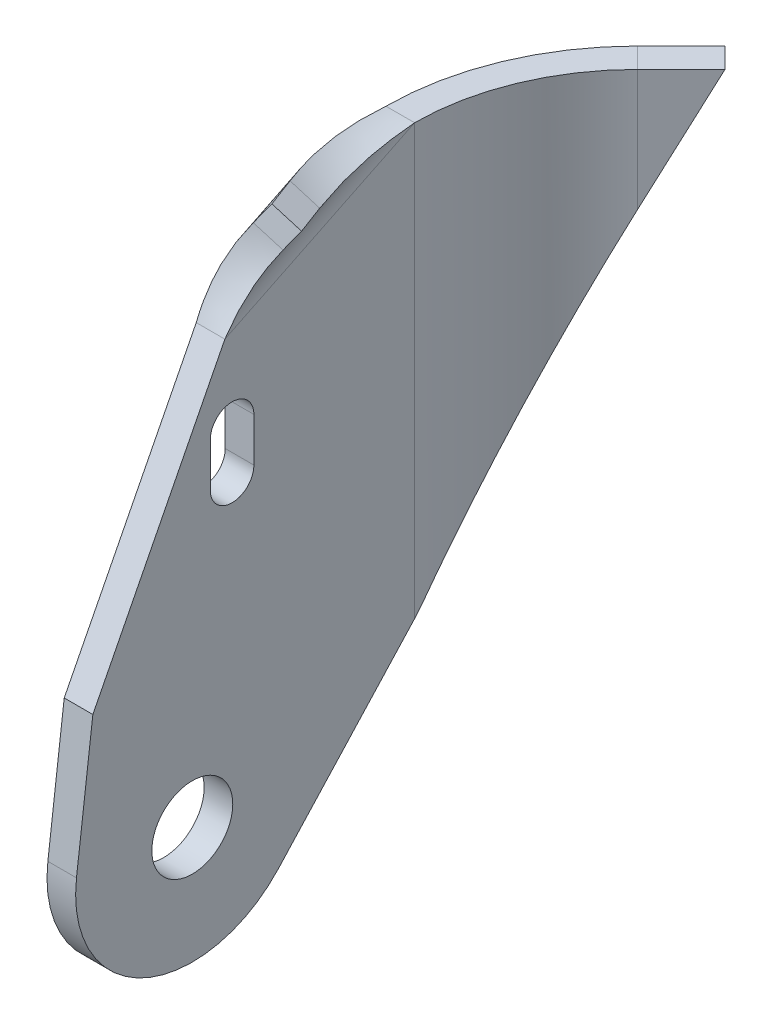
ISO-10303-21;
HEADER;
FILE_DESCRIPTION(('STEP AP214'),'2;1');
FILE_NAME('part.step','',(''),(''),'','','');
FILE_SCHEMA(('AUTOMOTIVE_DESIGN { 1 0 10303 214 1 1 1 1 }'));
ENDSEC;
DATA;
#1=APPLICATION_CONTEXT('core data for automotive mechanical design processes');
#2=APPLICATION_PROTOCOL_DEFINITION('international standard','automotive_design',2000,#1);
#3=PRODUCT_CONTEXT('',#1,'mechanical');
#4=PRODUCT('Part','Part','',(#3));
#5=PRODUCT_RELATED_PRODUCT_CATEGORY('part','',(#4));
#6=PRODUCT_DEFINITION_FORMATION('','',#4);
#7=PRODUCT_DEFINITION_CONTEXT('part definition',#1,'design');
#8=PRODUCT_DEFINITION('design','',#6,#7);
#9=PRODUCT_DEFINITION_SHAPE('','',#8);
#10=(LENGTH_UNIT() NAMED_UNIT(*) SI_UNIT(.MILLI.,.METRE.));
#11=(NAMED_UNIT(*) PLANE_ANGLE_UNIT() SI_UNIT($,.RADIAN.));
#12=(NAMED_UNIT(*) SI_UNIT($,.STERADIAN.) SOLID_ANGLE_UNIT());
#13=UNCERTAINTY_MEASURE_WITH_UNIT(LENGTH_MEASURE(1.E-05),#10,'distance_accuracy_value','');
#14=(GEOMETRIC_REPRESENTATION_CONTEXT(3) GLOBAL_UNCERTAINTY_ASSIGNED_CONTEXT((#13)) GLOBAL_UNIT_ASSIGNED_CONTEXT((#10,
#11,#12)) REPRESENTATION_CONTEXT('',''));
#15=CARTESIAN_POINT('',(0.,0.,0.));
#16=DIRECTION('',(0.,0.,1.));
#17=DIRECTION('',(1.,0.,0.));
#18=AXIS2_PLACEMENT_3D('',#15,#16,#17);
#19=CARTESIAN_POINT('',(3.30473425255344,-100.5332,3.30473425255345));
#20=DIRECTION('',(0.707106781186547,0.,0.707106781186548));
#21=DIRECTION('',(0.707106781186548,0.,-0.707106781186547));
#22=AXIS2_PLACEMENT_3D('',#19,#20,#21);
#23=PLANE('',#22);
#24=DIRECTION('',(0.,1.,0.));
#25=VECTOR('',#24,1.);
#26=CARTESIAN_POINT('',(15.3418254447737,-100.5332,-8.73235693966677));
#27=LINE('',#26,#25);
#28=CARTESIAN_POINT('',(15.3418254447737,-19.7797311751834,-8.73235693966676));
#29=VERTEX_POINT('',#28);
#30=CARTESIAN_POINT('',(15.3418254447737,0.,-8.73235693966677));
#31=VERTEX_POINT('',#30);
#32=EDGE_CURVE('E701',#29,#31,#27,.T.);
#33=ORIENTED_EDGE('',*,*,#32,.F.);
#34=DIRECTION('',(-0.321019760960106,-0.891006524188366,0.321019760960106));
#35=VECTOR('',#34,1.);
#36=CARTESIAN_POINT('',(-10.2370791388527,-90.7752698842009,16.8465476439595));
#37=LINE('',#36,#35);
#38=CARTESIAN_POINT('',(22.4682430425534,0.,-15.8587745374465));
#39=VERTEX_POINT('',#38);
#40=EDGE_CURVE('E938',#39,#29,#37,.T.);
#41=ORIENTED_EDGE('',*,*,#40,.F.);
#42=DIRECTION('',(0.707106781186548,0.,-0.707106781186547));
#43=VECTOR('',#42,1.);
#44=CARTESIAN_POINT('',(3.30473425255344,0.,3.30473425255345));
#45=LINE('',#44,#43);
#46=EDGE_CURVE('E692',#31,#39,#45,.T.);
#47=ORIENTED_EDGE('',*,*,#46,.F.);
#48=EDGE_LOOP('',(#33,#41,#47));
#49=FACE_BOUND('',#48,.T.);
#50=ADVANCED_FACE('F478',(#49),#23,.T.);
#51=CARTESIAN_POINT('',(41.0972,-100.5332,17.0230176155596));
#52=DIRECTION('',(0.,1.,0.));
#53=DIRECTION('',(0.,0.,1.));
#54=AXIS2_PLACEMENT_3D('',#51,#52,#53);
#55=CYLINDRICAL_SURFACE('',#54,36.4236);
#56=CARTESIAN_POINT('',(41.0972,-70.1097891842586,17.0230176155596));
#57=DIRECTION('',(0.,0.630892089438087,0.775870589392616));
#58=DIRECTION('',(0.,0.775870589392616,-0.630892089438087));
#59=AXIS2_PLACEMENT_3D('',#56,#57,#58);
#60=ELLIPSE('',#59,57.7334866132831,36.4236);
#61=CARTESIAN_POINT('',(4.69348604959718,-68.6298099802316,15.8195860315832));
#62=VERTEX_POINT('',#61);
#63=CARTESIAN_POINT('',(4.6736,-70.1097891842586,17.0230176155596));
#64=VERTEX_POINT('',#63);
#65=EDGE_CURVE('E623',#62,#64,#60,.T.);
#66=ORIENTED_EDGE('',*,*,#65,.F.);
#67=CARTESIAN_POINT('',(41.0972,-19.7797311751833,17.0230176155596));
#68=DIRECTION('',(-0.63003675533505,0.453990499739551,0.630036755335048));
#69=DIRECTION('',(0.321019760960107,0.891006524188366,-0.321019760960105));
#70=AXIS2_PLACEMENT_3D('',#67,#68,#69);
#71=ELLIPSE('',#70,80.2298726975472,36.4236);
#72=EDGE_CURVE('E494',#29,#62,#71,.T.);
#73=ORIENTED_EDGE('',*,*,#72,.F.);
#74=ORIENTED_EDGE('',*,*,#32,.T.);
#75=CARTESIAN_POINT('',(41.0972,0.,17.0230176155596));
#76=DIRECTION('',(0.,1.,0.));
#77=DIRECTION('',(1.,0.,0.));
#78=AXIS2_PLACEMENT_3D('',#75,#76,#77);
#79=CIRCLE('',#78,36.4236);
#80=CARTESIAN_POINT('',(4.6736,0.,17.0230176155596));
#81=VERTEX_POINT('',#80);
#82=EDGE_CURVE('E706',#81,#31,#79,.F.);
#83=ORIENTED_EDGE('',*,*,#82,.F.);
#84=DIRECTION('',(0.,1.,0.));
#85=VECTOR('',#84,1.);
#86=CARTESIAN_POINT('',(4.6736,-100.5332,17.0230176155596));
#87=LINE('',#86,#85);
#88=EDGE_CURVE('E502',#64,#81,#87,.T.);
#89=ORIENTED_EDGE('',*,*,#88,.F.);
#90=EDGE_LOOP('',(#66,#73,#74,#83,#89));
#91=FACE_BOUND('',#90,.T.);
#92=ADVANCED_FACE('F930',(#91),#55,.F.);
#93=CARTESIAN_POINT('',(41.0972,-100.5332,17.0230176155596));
#94=DIRECTION('',(0.,1.,0.));
#95=DIRECTION('',(0.,0.,1.));
#96=AXIS2_PLACEMENT_3D('',#93,#94,#95);
#97=CYLINDRICAL_SURFACE('',#96,41.0972);
#98=CARTESIAN_POINT('',(41.0972,-19.7797311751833,17.0230176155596));
#99=DIRECTION('',(-0.613020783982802,0.498408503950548,0.6130207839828));
#100=DIRECTION('',(0.352428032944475,0.866942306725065,-0.352428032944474));
#101=AXIS2_PLACEMENT_3D('',#98,#99,#100);
#102=ELLIPSE('',#101,82.456859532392,41.0972);
#103=CARTESIAN_POINT('',(12.0370911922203,-19.7797311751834,-12.0370911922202));
#104=VERTEX_POINT('',#103);
#105=CARTESIAN_POINT('',(0.0224376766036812,-68.6298099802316,15.6651708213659));
#106=VERTEX_POINT('',#105);
#107=EDGE_CURVE('E602',#104,#106,#102,.T.);
#108=ORIENTED_EDGE('',*,*,#107,.T.);
#109=CARTESIAN_POINT('',(41.0972,-70.1097891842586,17.0230176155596));
#110=DIRECTION('',(0.,0.676049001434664,0.736856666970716));
#111=DIRECTION('',(0.,0.736856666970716,-0.676049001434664));
#112=AXIS2_PLACEMENT_3D('',#109,#110,#111);
#113=ELLIPSE('',#112,60.7902680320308,41.0972);
#114=CARTESIAN_POINT('',(0.,-70.1097891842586,17.0230176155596));
#115=VERTEX_POINT('',#114);
#116=EDGE_CURVE('E613',#106,#115,#113,.T.);
#117=ORIENTED_EDGE('',*,*,#116,.T.);
#118=DIRECTION('',(0.,1.,0.));
#119=VECTOR('',#118,1.);
#120=CARTESIAN_POINT('',(0.,-100.5332,17.0230176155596));
#121=LINE('',#120,#119);
#122=CARTESIAN_POINT('',(-5.22363055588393E-09,0.,17.0230176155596));
#123=VERTEX_POINT('',#122);
#124=EDGE_CURVE('E705',#115,#123,#121,.T.);
#125=ORIENTED_EDGE('',*,*,#124,.T.);
#126=CARTESIAN_POINT('',(41.0972,0.,17.0230176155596));
#127=DIRECTION('',(0.,1.,0.));
#128=DIRECTION('',(0.,0.,1.));
#129=AXIS2_PLACEMENT_3D('',#126,#127,#128);
#130=CIRCLE('',#129,41.0972);
#131=CARTESIAN_POINT('',(12.0370911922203,0.,-12.0370911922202));
#132=VERTEX_POINT('',#131);
#133=EDGE_CURVE('E700',#123,#132,#130,.F.);
#134=ORIENTED_EDGE('',*,*,#133,.T.);
#135=DIRECTION('',(0.,1.,0.));
#136=VECTOR('',#135,1.);
#137=CARTESIAN_POINT('',(12.0370911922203,-100.5332,-12.0370911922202));
#138=LINE('',#137,#136);
#139=EDGE_CURVE('E616',#104,#132,#138,.T.);
#140=ORIENTED_EDGE('',*,*,#139,.F.);
#141=EDGE_LOOP('',(#108,#117,#125,#134,#140));
#142=FACE_BOUND('',#141,.T.);
#143=ADVANCED_FACE('F611',(#142),#97,.T.);
#144=CARTESIAN_POINT('',(0.,-100.5332,0.));
#145=DIRECTION('',(0.707106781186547,0.,0.707106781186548));
#146=DIRECTION('',(0.707106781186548,0.,-0.707106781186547));
#147=AXIS2_PLACEMENT_3D('',#144,#145,#146);
#148=PLANE('',#147);
#149=DIRECTION('',(-0.321019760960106,-0.891006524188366,0.321019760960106));
#150=VECTOR('',#149,1.);
#151=CARTESIAN_POINT('',(-13.5418133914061,-90.7752698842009,13.5418133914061));
#152=LINE('',#151,#150);
#153=CARTESIAN_POINT('',(19.16350879,0.,-19.16350879));
#154=VERTEX_POINT('',#153);
#155=EDGE_CURVE('E607',#154,#104,#152,.T.);
#156=ORIENTED_EDGE('',*,*,#155,.T.);
#157=ORIENTED_EDGE('',*,*,#139,.T.);
#158=DIRECTION('',(0.707106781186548,0.,-0.707106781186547));
#159=VECTOR('',#158,1.);
#160=CARTESIAN_POINT('',(0.,0.,0.));
#161=LINE('',#160,#159);
#162=EDGE_CURVE('E697',#132,#154,#161,.T.);
#163=ORIENTED_EDGE('',*,*,#162,.T.);
#164=EDGE_LOOP('',(#156,#157,#163));
#165=FACE_BOUND('',#164,.T.);
#166=ADVANCED_FACE('F1039',(#165),#148,.F.);
#167=CARTESIAN_POINT('',(41.0972,-25.3160748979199,-19.4005823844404));
#168=CARTESIAN_POINT('',(41.0972,-25.3160748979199,-20.9584490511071));
#169=CARTESIAN_POINT('',(41.0972,-25.3160748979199,-22.5163157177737));
#170=CARTESIAN_POINT('',(41.0972,-25.3160748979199,-24.0741823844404));
#171=CARTESIAN_POINT('',(-31.75,-25.3160748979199,-19.4005823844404));
#172=CARTESIAN_POINT('',(-34.8657333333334,-25.3160748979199,-20.9584490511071));
#173=CARTESIAN_POINT('',(-37.9814666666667,-25.3160748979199,-22.5163157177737));
#174=CARTESIAN_POINT('',(-41.0972,-25.3160748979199,-24.0741823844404));
#175=CARTESIAN_POINT('',(-31.75,-114.903503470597,53.4466176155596));
#176=CARTESIAN_POINT('',(-34.8657333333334,-114.903503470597,55.0044842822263));
#177=CARTESIAN_POINT('',(-37.9814666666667,-114.903503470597,56.5623509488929));
#178=CARTESIAN_POINT('',(-41.0972,-114.903503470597,58.1202176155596));
#179=CARTESIAN_POINT('',(41.0972,-114.903503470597,53.4466176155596));
#180=CARTESIAN_POINT('',(41.0972,-114.903503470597,55.0044842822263));
#181=CARTESIAN_POINT('',(41.0972,-114.903503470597,56.5623509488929));
#182=CARTESIAN_POINT('',(41.0972,-114.903503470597,58.1202176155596));
#183=CARTESIAN_POINT('',(113.9444,-114.903503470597,53.4466176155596));
#184=CARTESIAN_POINT('',(117.060133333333,-114.903503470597,55.0044842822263));
#185=CARTESIAN_POINT('',(120.175866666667,-114.903503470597,56.562350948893));
#186=CARTESIAN_POINT('',(123.2916,-114.903503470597,58.1202176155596));
#187=CARTESIAN_POINT('',(113.9444,-25.3160748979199,-19.4005823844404));
#188=CARTESIAN_POINT('',(117.060133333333,-25.3160748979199,-20.9584490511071));
#189=CARTESIAN_POINT('',(120.175866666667,-25.3160748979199,-22.5163157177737));
#190=CARTESIAN_POINT('',(123.2916,-25.3160748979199,-24.0741823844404));
#191=CARTESIAN_POINT('',(41.0972,-25.3160748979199,-19.4005823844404));
#192=CARTESIAN_POINT('',(41.0972,-25.3160748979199,-20.9584490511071));
#193=CARTESIAN_POINT('',(41.0972,-25.3160748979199,-22.5163157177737));
#194=CARTESIAN_POINT('',(41.0972,-25.3160748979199,-24.0741823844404));
#195=(BOUNDED_SURFACE() B_SPLINE_SURFACE(3,3,((#167,#168,#169,#170),(#171,#172,#173,#174),(#175,
#176,#177,#178),(#179,#180,#181,#182),(#183,#184,#185,#186),(#187,#188,#189,#190),(#191,#192,
#193,#194)),.UNSPECIFIED.,.T.,.F.,.F.) B_SPLINE_SURFACE_WITH_KNOTS((4,3,4),(4,4),(0.,0.5,1.),
(0.,1.),.UNSPECIFIED.) GEOMETRIC_REPRESENTATION_ITEM() RATIONAL_B_SPLINE_SURFACE(((1.,1.,1.,1.),
(0.333333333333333,0.333333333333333,0.333333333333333,0.333333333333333),(0.333333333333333,
0.333333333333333,0.333333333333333,0.333333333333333),(1.,1.,1.,1.),(0.333333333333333,
0.333333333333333,0.333333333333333,0.333333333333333),(0.333333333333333,0.333333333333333,
0.333333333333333,0.333333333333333),(1.,1.,1.,1.))) REPRESENTATION_ITEM('') SURFACE());
#196=DIRECTION('',(0.999454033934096,0.,0.0330398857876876));
#197=VECTOR('',#196,1.);
#198=CARTESIAN_POINT('',(4.69348604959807,-68.6298099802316,15.8195860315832));
#199=LINE('',#198,#197);
#200=EDGE_CURVE('E599',#62,#106,#199,.F.);
#201=DIRECTION('',(1.,0.,0.));
#202=VECTOR('',#201,1.);
#203=CARTESIAN_POINT('',(4.6736,-70.1097891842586,17.0230176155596));
#204=LINE('',#203,#202);
#205=EDGE_CURVE('E620',#64,#115,#204,.F.);
#206=ORIENTED_EDGE('',*,*,#116,.F.);
#207=ORIENTED_EDGE('',*,*,#200,.F.);
#208=ORIENTED_EDGE('',*,*,#65,.T.);
#209=ORIENTED_EDGE('',*,*,#205,.T.);
#210=EDGE_LOOP('',(#206,#207,#208,#209));
#211=FACE_BOUND('',#210,.T.);
#212=ADVANCED_FACE('F618',(#211),#195,.T.);
#213=CARTESIAN_POINT('',(4.6736,-92.7813827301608,87.5747183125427));
#214=DIRECTION('',(0.,-0.453990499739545,-0.891006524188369));
#215=DIRECTION('',(0.,0.891006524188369,-0.453990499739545));
#216=AXIS2_PLACEMENT_3D('',#213,#214,#215);
#217=PLANE('',#216);
#218=DIRECTION('',(0.,0.891006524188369,-0.453990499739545));
#219=VECTOR('',#218,1.);
#220=CARTESIAN_POINT('',(4.6736,-92.7813827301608,87.5747183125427));
#221=LINE('',#220,#219);
#222=CARTESIAN_POINT('',(4.6736,-57.399829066,69.546916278));
#223=VERTEX_POINT('',#222);
#224=CARTESIAN_POINT('',(4.6736,-15.1074450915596,47.9978703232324));
#225=VERTEX_POINT('',#224);
#226=EDGE_CURVE('E649',#223,#225,#221,.T.);
#227=ORIENTED_EDGE('',*,*,#226,.T.);
#228=CARTESIAN_POINT('',(-5.22363055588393E-09,-15.1074450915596,47.9978703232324));
#229=CARTESIAN_POINT('',(4.67359999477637,-15.1074450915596,47.9978703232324));
#230=B_SPLINE_CURVE_WITH_KNOTS('',1,(#228,#229),.UNSPECIFIED.,.F.,.F.,(2,2),(0.,1.),.UNSPECIFIED.);
#231=CARTESIAN_POINT('',(0.,-15.1074450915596,47.9978703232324));
#232=VERTEX_POINT('',#231);
#233=EDGE_CURVE('E718',#225,#232,#230,.F.);
#234=ORIENTED_EDGE('',*,*,#233,.T.);
#235=DIRECTION('',(0.,0.891006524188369,-0.453990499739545));
#236=VECTOR('',#235,1.);
#237=CARTESIAN_POINT('',(0.,-92.7813827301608,87.5747183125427));
#238=LINE('',#237,#236);
#239=CARTESIAN_POINT('',(0.,-57.399829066,69.546916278));
#240=VERTEX_POINT('',#239);
#241=EDGE_CURVE('E644',#240,#232,#238,.T.);
#242=ORIENTED_EDGE('',*,*,#241,.F.);
#243=DIRECTION('',(1.,0.,0.));
#244=VECTOR('',#243,1.);
#245=CARTESIAN_POINT('',(4.6736,-57.399829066,69.546916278));
#246=LINE('',#245,#244);
#247=EDGE_CURVE('E641',#223,#240,#246,.F.);
#248=ORIENTED_EDGE('',*,*,#247,.F.);
#249=EDGE_LOOP('',(#227,#234,#242,#248));
#250=FACE_BOUND('',#249,.T.);
#251=ADVANCED_FACE('F746',(#250),#217,.F.);
#252=CARTESIAN_POINT('',(4.6736,-100.5332,72.360920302));
#253=DIRECTION('',(1.,0.,0.));
#254=DIRECTION('',(0.,0.,-1.));
#255=AXIS2_PLACEMENT_3D('',#252,#253,#254);
#256=PLANE('',#255);
#257=CARTESIAN_POINT('',(4.6736,-35.2806,46.816296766));
#258=DIRECTION('',(1.,0.,0.));
#259=DIRECTION('',(0.,0.,-1.));
#260=AXIS2_PLACEMENT_3D('',#257,#258,#259);
#261=CIRCLE('',#260,3.556);
#262=CARTESIAN_POINT('',(4.6736,-35.2806,50.372296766));
#263=VERTEX_POINT('',#262);
#264=CARTESIAN_POINT('',(4.6736,-35.2806,43.260296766));
#265=VERTEX_POINT('',#264);
#266=EDGE_CURVE('E657',#263,#265,#261,.T.);
#267=ORIENTED_EDGE('',*,*,#266,.F.);
#268=DIRECTION('',(0.,-1.,0.));
#269=VECTOR('',#268,1.);
#270=CARTESIAN_POINT('',(4.6736,-100.5332,50.372296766));
#271=LINE('',#270,#269);
#272=CARTESIAN_POINT('',(4.6736,-28.1178,50.372296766));
#273=VERTEX_POINT('',#272);
#274=EDGE_CURVE('E655',#273,#263,#271,.T.);
#275=ORIENTED_EDGE('',*,*,#274,.F.);
#276=CARTESIAN_POINT('',(4.6736,-28.1178,46.816296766));
#277=DIRECTION('',(1.,0.,0.));
#278=DIRECTION('',(0.,0.,-1.));
#279=AXIS2_PLACEMENT_3D('',#276,#277,#278);
#280=CIRCLE('',#279,3.556);
#281=CARTESIAN_POINT('',(4.6736,-28.1178,43.260296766));
#282=VERTEX_POINT('',#281);
#283=EDGE_CURVE('E653',#282,#273,#280,.T.);
#284=ORIENTED_EDGE('',*,*,#283,.F.);
#285=DIRECTION('',(0.,1.,0.));
#286=VECTOR('',#285,1.);
#287=CARTESIAN_POINT('',(4.6736,-100.5332,43.260296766));
#288=LINE('',#287,#286);
#289=EDGE_CURVE('E650',#265,#282,#288,.T.);
#290=ORIENTED_EDGE('',*,*,#289,.F.);
#291=EDGE_LOOP('',(#267,#275,#284,#290));
#292=FACE_BOUND('',#291,.T.);
#293=CARTESIAN_POINT('',(4.6736,-81.4832,53.310920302));
#294=DIRECTION('',(1.,0.,0.));
#295=DIRECTION('',(0.,0.,-1.));
#296=AXIS2_PLACEMENT_3D('',#293,#294,#295);
#297=CIRCLE('',#296,6.604);
#298=CARTESIAN_POINT('',(4.6736,-81.4832,46.706920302));
#299=VERTEX_POINT('',#298);
#300=EDGE_CURVE('E686',#299,#299,#297,.T.);
#301=ORIENTED_EDGE('',*,*,#300,.F.);
#302=EDGE_LOOP('',(#301));
#303=FACE_BOUND('',#302,.T.);
#304=ORIENTED_EDGE('',*,*,#88,.T.);
#305=DIRECTION('',(0.,-0.438371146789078,0.898794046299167));
#306=VECTOR('',#305,1.);
#307=CARTESIAN_POINT('',(4.6736,-41.122822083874,101.337297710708));
#308=LINE('',#307,#306);
#309=EDGE_CURVE('E487',#81,#225,#308,.T.);
#310=ORIENTED_EDGE('',*,*,#309,.T.);
#311=ORIENTED_EDGE('',*,*,#226,.F.);
#312=DIRECTION('',(0.,0.992546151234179,-0.121869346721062));
#313=VECTOR('',#312,1.);
#314=CARTESIAN_POINT('',(4.6736,-100.232961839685,74.8061638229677));
#315=LINE('',#314,#313);
#316=CARTESIAN_POINT('',(4.6736,-79.1615889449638,72.2189244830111));
#317=VERTEX_POINT('',#316);
#318=EDGE_CURVE('E647',#317,#223,#315,.T.);
#319=ORIENTED_EDGE('',*,*,#318,.F.);
#320=CARTESIAN_POINT('',(4.6736,-81.4832,53.310920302));
#321=DIRECTION('',(1.,0.,0.));
#322=DIRECTION('',(0.,0.,-1.));
#323=AXIS2_PLACEMENT_3D('',#320,#321,#322);
#324=CIRCLE('',#323,19.05);
#325=CARTESIAN_POINT('',(4.6736,-94.3619334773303,39.2738007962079));
#326=VERTEX_POINT('',#325);
#327=EDGE_CURVE('E684',#317,#326,#324,.T.);
#328=ORIENTED_EDGE('',*,*,#327,.T.);
#329=DIRECTION('',(0.,-0.736856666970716,0.676049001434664));
#330=VECTOR('',#329,1.);
#331=CARTESIAN_POINT('',(4.6736,-114.195059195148,57.4702363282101));
#332=LINE('',#331,#330);
#333=EDGE_CURVE('E628',#64,#326,#332,.T.);
#334=ORIENTED_EDGE('',*,*,#333,.F.);
#335=EDGE_LOOP('',(#304,#310,#311,#319,#328,#334));
#336=FACE_BOUND('',#335,.T.);
#337=ADVANCED_FACE('F480',(#292,#303,#336),#256,.T.);
#338=CARTESIAN_POINT('',(0.,-100.5332,72.360920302));
#339=DIRECTION('',(1.,0.,0.));
#340=DIRECTION('',(0.,0.,-1.));
#341=AXIS2_PLACEMENT_3D('',#338,#339,#340);
#342=PLANE('',#341);
#343=DIRECTION('',(0.,-0.438371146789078,0.898794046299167));
#344=VECTOR('',#343,1.);
#345=CARTESIAN_POINT('',(0.,-41.122822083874,101.337297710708));
#346=LINE('',#345,#344);
#347=EDGE_CURVE('E709',#123,#232,#346,.T.);
#348=ORIENTED_EDGE('',*,*,#347,.F.);
#349=ORIENTED_EDGE('',*,*,#124,.F.);
#350=DIRECTION('',(0.,-0.736856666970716,0.676049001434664));
#351=VECTOR('',#350,1.);
#352=CARTESIAN_POINT('',(0.,-114.195059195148,57.4702363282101));
#353=LINE('',#352,#351);
#354=CARTESIAN_POINT('',(0.,-94.3619334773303,39.2738007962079));
#355=VERTEX_POINT('',#354);
#356=EDGE_CURVE('E900',#115,#355,#353,.T.);
#357=ORIENTED_EDGE('',*,*,#356,.T.);
#358=CARTESIAN_POINT('',(0.,-81.4832,53.310920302));
#359=DIRECTION('',(1.,0.,0.));
#360=DIRECTION('',(0.,0.,1.));
#361=AXIS2_PLACEMENT_3D('',#358,#359,#360);
#362=CIRCLE('',#361,19.05);
#363=CARTESIAN_POINT('',(0.,-79.1615889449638,72.2189244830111));
#364=VERTEX_POINT('',#363);
#365=EDGE_CURVE('E680',#364,#355,#362,.T.);
#366=ORIENTED_EDGE('',*,*,#365,.F.);
#367=DIRECTION('',(0.,0.992546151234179,-0.121869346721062));
#368=VECTOR('',#367,1.);
#369=CARTESIAN_POINT('',(0.,-100.232961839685,74.8061638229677));
#370=LINE('',#369,#368);
#371=EDGE_CURVE('E626',#364,#240,#370,.T.);
#372=ORIENTED_EDGE('',*,*,#371,.T.);
#373=ORIENTED_EDGE('',*,*,#241,.T.);
#374=EDGE_LOOP('',(#348,#349,#357,#366,#372,#373));
#375=FACE_BOUND('',#374,.T.);
#376=CARTESIAN_POINT('',(0.,-81.4832,53.310920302));
#377=DIRECTION('',(1.,0.,0.));
#378=DIRECTION('',(0.,0.,-1.));
#379=AXIS2_PLACEMENT_3D('',#376,#377,#378);
#380=CIRCLE('',#379,6.604);
#381=CARTESIAN_POINT('',(0.,-81.4832,46.706920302));
#382=VERTEX_POINT('',#381);
#383=EDGE_CURVE('E689',#382,#382,#380,.T.);
#384=ORIENTED_EDGE('',*,*,#383,.T.);
#385=EDGE_LOOP('',(#384));
#386=FACE_BOUND('',#385,.T.);
#387=DIRECTION('',(0.,1.,0.));
#388=VECTOR('',#387,1.);
#389=CARTESIAN_POINT('',(0.,-100.5332,50.372296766));
#390=LINE('',#389,#388);
#391=CARTESIAN_POINT('',(0.,-28.1178,50.372296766));
#392=VERTEX_POINT('',#391);
#393=CARTESIAN_POINT('',(0.,-35.2806,50.372296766));
#394=VERTEX_POINT('',#393);
#395=EDGE_CURVE('E667',#392,#394,#390,.F.);
#396=ORIENTED_EDGE('',*,*,#395,.T.);
#397=CARTESIAN_POINT('',(0.,-35.2806,46.816296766));
#398=DIRECTION('',(1.,0.,0.));
#399=DIRECTION('',(0.,0.,-1.));
#400=AXIS2_PLACEMENT_3D('',#397,#398,#399);
#401=CIRCLE('',#400,3.556);
#402=CARTESIAN_POINT('',(0.,-35.2806,43.260296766));
#403=VERTEX_POINT('',#402);
#404=EDGE_CURVE('E663',#394,#403,#401,.T.);
#405=ORIENTED_EDGE('',*,*,#404,.T.);
#406=DIRECTION('',(0.,1.,0.));
#407=VECTOR('',#406,1.);
#408=CARTESIAN_POINT('',(0.,-100.5332,43.260296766));
#409=LINE('',#408,#407);
#410=CARTESIAN_POINT('',(0.,-28.1178,43.260296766));
#411=VERTEX_POINT('',#410);
#412=EDGE_CURVE('E659',#403,#411,#409,.T.);
#413=ORIENTED_EDGE('',*,*,#412,.T.);
#414=CARTESIAN_POINT('',(0.,-28.1178,46.816296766));
#415=DIRECTION('',(1.,0.,0.));
#416=DIRECTION('',(0.,0.,-1.));
#417=AXIS2_PLACEMENT_3D('',#414,#415,#416);
#418=CIRCLE('',#417,3.556);
#419=EDGE_CURVE('E662',#411,#392,#418,.T.);
#420=ORIENTED_EDGE('',*,*,#419,.T.);
#421=EDGE_LOOP('',(#396,#405,#413,#420));
#422=FACE_BOUND('',#421,.T.);
#423=ADVANCED_FACE('F742',(#375,#386,#422),#342,.F.);
#424=CARTESIAN_POINT('',(12.0370911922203,0.,-12.0370911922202));
#425=DIRECTION('',(0.,1.,0.));
#426=DIRECTION('',(0.,0.,1.));
#427=AXIS2_PLACEMENT_3D('',#424,#425,#426);
#428=PLANE('',#427);
#429=DIRECTION('',(0.707106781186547,0.,0.707106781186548));
#430=VECTOR('',#429,1.);
#431=CARTESIAN_POINT('',(12.0370911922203,0.,-12.0370911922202));
#432=LINE('',#431,#430);
#433=EDGE_CURVE('E703',#132,#31,#432,.T.);
#434=ORIENTED_EDGE('',*,*,#433,.F.);
#435=ORIENTED_EDGE('',*,*,#133,.F.);
#436=CARTESIAN_POINT('',(4.67359999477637,0.,17.0230176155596));
#437=CARTESIAN_POINT('',(-5.22363055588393E-09,0.,17.0230176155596));
#438=B_SPLINE_CURVE_WITH_KNOTS('',1,(#436,#437),.UNSPECIFIED.,.F.,.F.,(2,2),(0.,1.),.UNSPECIFIED.);
#439=EDGE_CURVE('E12',#81,#123,#438,.T.);
#440=ORIENTED_EDGE('',*,*,#439,.F.);
#441=ORIENTED_EDGE('',*,*,#82,.T.);
#442=EDGE_LOOP('',(#434,#435,#440,#441));
#443=FACE_BOUND('',#442,.T.);
#444=ADVANCED_FACE('F731',(#443),#428,.T.);
#445=CARTESIAN_POINT('',(4.6736,0.,17.0230176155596));
#446=DIRECTION('',(0.,1.,0.));
#447=DIRECTION('',(0.,0.,1.));
#448=AXIS2_PLACEMENT_3D('',#445,#446,#447);
#449=PLANE('',#448);
#450=ORIENTED_EDGE('',*,*,#162,.F.);
#451=ORIENTED_EDGE('',*,*,#433,.T.);
#452=ORIENTED_EDGE('',*,*,#46,.T.);
#453=DIRECTION('',(0.707106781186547,0.,0.707106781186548));
#454=VECTOR('',#453,1.);
#455=CARTESIAN_POINT('',(19.16350879,0.,-19.16350879));
#456=LINE('',#455,#454);
#457=EDGE_CURVE('E695',#154,#39,#456,.T.);
#458=ORIENTED_EDGE('',*,*,#457,.F.);
#459=EDGE_LOOP('',(#450,#451,#452,#458));
#460=FACE_BOUND('',#459,.T.);
#461=ADVANCED_FACE('F741',(#460),#449,.T.);
#462=CARTESIAN_POINT('',(4.6736,-81.4832,53.310920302));
#463=DIRECTION('',(1.,0.,0.));
#464=DIRECTION('',(0.,0.,-1.));
#465=AXIS2_PLACEMENT_3D('',#462,#463,#464);
#466=CYLINDRICAL_SURFACE('',#465,6.604);
#467=ORIENTED_EDGE('',*,*,#383,.F.);
#468=EDGE_LOOP('',(#467));
#469=FACE_BOUND('',#468,.T.);
#470=ORIENTED_EDGE('',*,*,#300,.T.);
#471=EDGE_LOOP('',(#470));
#472=FACE_BOUND('',#471,.T.);
#473=ADVANCED_FACE('F1045',(#469,#472),#466,.F.);
#474=CARTESIAN_POINT('',(0.,-81.4832,53.310920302));
#475=DIRECTION('',(1.,0.,0.));
#476=DIRECTION('',(0.,0.,-1.));
#477=AXIS2_PLACEMENT_3D('',#474,#475,#476);
#478=CYLINDRICAL_SURFACE('',#477,19.05);
#479=ORIENTED_EDGE('',*,*,#327,.F.);
#480=DIRECTION('',(1.,0.,0.));
#481=VECTOR('',#480,1.);
#482=CARTESIAN_POINT('',(4.6736,-79.1615889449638,72.2189244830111));
#483=LINE('',#482,#481);
#484=EDGE_CURVE('E622',#317,#364,#483,.F.);
#485=ORIENTED_EDGE('',*,*,#484,.T.);
#486=ORIENTED_EDGE('',*,*,#365,.T.);
#487=DIRECTION('',(1.,0.,0.));
#488=VECTOR('',#487,1.);
#489=CARTESIAN_POINT('',(4.6736,-94.3619334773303,39.2738007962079));
#490=LINE('',#489,#488);
#491=EDGE_CURVE('E901',#326,#355,#490,.F.);
#492=ORIENTED_EDGE('',*,*,#491,.F.);
#493=EDGE_LOOP('',(#479,#485,#486,#492));
#494=FACE_BOUND('',#493,.T.);
#495=ADVANCED_FACE('F909',(#494),#478,.T.);
#496=CARTESIAN_POINT('',(4.6736,-100.5332,50.372296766));
#497=DIRECTION('',(0.,0.,1.));
#498=DIRECTION('',(0.,-1.,0.));
#499=AXIS2_PLACEMENT_3D('',#496,#497,#498);
#500=PLANE('',#499);
#501=DIRECTION('',(1.,0.,0.));
#502=VECTOR('',#501,1.);
#503=CARTESIAN_POINT('',(4.6736,-28.1178,50.372296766));
#504=LINE('',#503,#502);
#505=EDGE_CURVE('E678',#273,#392,#504,.F.);
#506=ORIENTED_EDGE('',*,*,#505,.F.);
#507=ORIENTED_EDGE('',*,*,#274,.T.);
#508=DIRECTION('',(1.,0.,0.));
#509=VECTOR('',#508,1.);
#510=CARTESIAN_POINT('',(4.6736,-35.2806,50.372296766));
#511=LINE('',#510,#509);
#512=EDGE_CURVE('E675',#263,#394,#511,.F.);
#513=ORIENTED_EDGE('',*,*,#512,.T.);
#514=ORIENTED_EDGE('',*,*,#395,.F.);
#515=EDGE_LOOP('',(#506,#507,#513,#514));
#516=FACE_BOUND('',#515,.T.);
#517=ADVANCED_FACE('F1051',(#516),#500,.F.);
#518=CARTESIAN_POINT('',(4.6736,-35.2806,46.816296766));
#519=DIRECTION('',(1.,0.,0.));
#520=DIRECTION('',(0.,0.,-1.));
#521=AXIS2_PLACEMENT_3D('',#518,#519,#520);
#522=CYLINDRICAL_SURFACE('',#521,3.556);
#523=ORIENTED_EDGE('',*,*,#512,.F.);
#524=ORIENTED_EDGE('',*,*,#266,.T.);
#525=DIRECTION('',(1.,0.,0.));
#526=VECTOR('',#525,1.);
#527=CARTESIAN_POINT('',(4.6736,-35.2806,43.260296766));
#528=LINE('',#527,#526);
#529=EDGE_CURVE('E672',#265,#403,#528,.F.);
#530=ORIENTED_EDGE('',*,*,#529,.T.);
#531=ORIENTED_EDGE('',*,*,#404,.F.);
#532=EDGE_LOOP('',(#523,#524,#530,#531));
#533=FACE_BOUND('',#532,.T.);
#534=ADVANCED_FACE('F1059',(#533),#522,.F.);
#535=CARTESIAN_POINT('',(4.6736,-100.5332,43.260296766));
#536=DIRECTION('',(0.,0.,-1.));
#537=DIRECTION('',(0.,1.,0.));
#538=AXIS2_PLACEMENT_3D('',#535,#536,#537);
#539=PLANE('',#538);
#540=ORIENTED_EDGE('',*,*,#529,.F.);
#541=ORIENTED_EDGE('',*,*,#289,.T.);
#542=DIRECTION('',(1.,0.,0.));
#543=VECTOR('',#542,1.);
#544=CARTESIAN_POINT('',(4.6736,-28.1178,43.260296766));
#545=LINE('',#544,#543);
#546=EDGE_CURVE('E666',#282,#411,#545,.F.);
#547=ORIENTED_EDGE('',*,*,#546,.T.);
#548=ORIENTED_EDGE('',*,*,#412,.F.);
#549=EDGE_LOOP('',(#540,#541,#547,#548));
#550=FACE_BOUND('',#549,.T.);
#551=ADVANCED_FACE('F1055',(#550),#539,.F.);
#552=CARTESIAN_POINT('',(4.6736,-28.1178,46.816296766));
#553=DIRECTION('',(1.,0.,0.));
#554=DIRECTION('',(0.,0.,-1.));
#555=AXIS2_PLACEMENT_3D('',#552,#553,#554);
#556=CYLINDRICAL_SURFACE('',#555,3.556);
#557=ORIENTED_EDGE('',*,*,#283,.T.);
#558=ORIENTED_EDGE('',*,*,#505,.T.);
#559=ORIENTED_EDGE('',*,*,#419,.F.);
#560=ORIENTED_EDGE('',*,*,#546,.F.);
#561=EDGE_LOOP('',(#557,#558,#559,#560));
#562=FACE_BOUND('',#561,.T.);
#563=ADVANCED_FACE('F1052',(#562),#556,.F.);
#564=CARTESIAN_POINT('',(4.6736,-100.232961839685,74.8061638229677));
#565=DIRECTION('',(0.,-0.121869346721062,-0.992546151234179));
#566=DIRECTION('',(0.,0.992546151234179,-0.121869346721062));
#567=AXIS2_PLACEMENT_3D('',#564,#565,#566);
#568=PLANE('',#567);
#569=ORIENTED_EDGE('',*,*,#484,.F.);
#570=ORIENTED_EDGE('',*,*,#318,.T.);
#571=ORIENTED_EDGE('',*,*,#247,.T.);
#572=ORIENTED_EDGE('',*,*,#371,.F.);
#573=EDGE_LOOP('',(#569,#570,#571,#572));
#574=FACE_BOUND('',#573,.T.);
#575=ADVANCED_FACE('F915',(#574),#568,.F.);
#576=CARTESIAN_POINT('',(4.6736,-114.195059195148,57.4702363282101));
#577=DIRECTION('',(0.,0.676049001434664,0.736856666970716));
#578=DIRECTION('',(0.,-0.736856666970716,0.676049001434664));
#579=AXIS2_PLACEMENT_3D('',#576,#577,#578);
#580=PLANE('',#579);
#581=ORIENTED_EDGE('',*,*,#333,.T.);
#582=ORIENTED_EDGE('',*,*,#491,.T.);
#583=ORIENTED_EDGE('',*,*,#356,.F.);
#584=ORIENTED_EDGE('',*,*,#205,.F.);
#585=EDGE_LOOP('',(#581,#582,#583,#584));
#586=FACE_BOUND('',#585,.T.);
#587=ADVANCED_FACE('F866',(#586),#580,.F.);
#588=CARTESIAN_POINT('',(3.48388084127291,0.760510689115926,36.1672461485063));
#589=CARTESIAN_POINT('',(2.37502112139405,0.886474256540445,33.0996884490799));
#590=CARTESIAN_POINT('',(1.4947423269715,0.82810577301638,29.9424469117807));
#591=CARTESIAN_POINT('',(0.30703471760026,0.512755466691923,23.5308727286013));
#592=CARTESIAN_POINT('',(-5.22362791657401E-09,0.256609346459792,20.27716859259));
#593=CARTESIAN_POINT('',(-5.22363055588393E-09,0.,17.0230176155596));
#594=CARTESIAN_POINT('',(6.95704249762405,-2.05024191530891,34.7963505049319));
#595=CARTESIAN_POINT('',(6.23027451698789,-1.54289142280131,31.9148624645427));
#596=CARTESIAN_POINT('',(5.6533000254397,-1.15637002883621,28.9745533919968));
#597=CARTESIAN_POINT('',(4.8748399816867,-0.513492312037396,23.0303382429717));
#598=CARTESIAN_POINT('',(4.67359999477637,-0.256604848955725,20.0268024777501));
#599=CARTESIAN_POINT('',(4.67359999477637,0.,17.0230176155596));
#600=B_SPLINE_SURFACE_WITH_KNOTS('',1,3,((#588,#589,#590,#591,#592,#593),(#594,#595,#596,#597,
#598,#599)),.UNSPECIFIED.,.F.,.F.,.F.,(2,2),(4,2,4),(0.,1.),(0.,0.5,1.),.UNSPECIFIED.);
#601=CARTESIAN_POINT('',(3.48388084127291,0.760510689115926,36.1672461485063));
#602=CARTESIAN_POINT('',(6.95704249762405,-2.05024191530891,34.7963505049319));
#603=B_SPLINE_CURVE_WITH_KNOTS('',1,(#601,#602),.UNSPECIFIED.,.F.,.F.,(2,2),(0.,1.),.UNSPECIFIED.);
#604=CARTESIAN_POINT('',(3.48388084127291,0.760510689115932,36.1672461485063));
#605=VERTEX_POINT('',#604);
#606=CARTESIAN_POINT('',(6.95704250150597,-2.05024191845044,34.7963505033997));
#607=VERTEX_POINT('',#606);
#608=EDGE_CURVE('E942',#605,#607,#603,.T.);
#609=CARTESIAN_POINT('',(6.95704249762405,-2.05024191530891,34.7963505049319));
#610=CARTESIAN_POINT('',(6.23027451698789,-1.54289142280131,31.9148624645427));
#611=CARTESIAN_POINT('',(5.6533000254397,-1.15637002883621,28.9745533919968));
#612=CARTESIAN_POINT('',(4.8748399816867,-0.513492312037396,23.0303382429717));
#613=CARTESIAN_POINT('',(4.67359999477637,-0.256604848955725,20.0268024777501));
#614=CARTESIAN_POINT('',(4.67359999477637,0.,17.0230176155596));
#615=B_SPLINE_CURVE_WITH_KNOTS('',3,(#609,#610,#611,#612,#613,#614),.UNSPECIFIED.,.F.,.F.,(4,2,
4),(0.,0.5,1.),.UNSPECIFIED.);
#616=EDGE_CURVE('E966',#607,#81,#615,.T.);
#617=CARTESIAN_POINT('',(-5.22363055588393E-09,0.,17.0230176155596));
#618=CARTESIAN_POINT('',(-5.22362791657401E-09,0.256609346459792,20.27716859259));
#619=CARTESIAN_POINT('',(0.30703471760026,0.512755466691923,23.5308727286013));
#620=CARTESIAN_POINT('',(1.4947423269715,0.82810577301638,29.9424469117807));
#621=CARTESIAN_POINT('',(2.37502112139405,0.886474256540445,33.0996884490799));
#622=CARTESIAN_POINT('',(3.48388084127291,0.760510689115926,36.1672461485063));
#623=B_SPLINE_CURVE_WITH_KNOTS('',3,(#617,#618,#619,#620,#621,#622),.UNSPECIFIED.,.F.,.F.,(4,2,
4),(0.,0.5,1.),.UNSPECIFIED.);
#624=EDGE_CURVE('E963',#605,#123,#623,.F.);
#625=ORIENTED_EDGE('',*,*,#608,.T.);
#626=ORIENTED_EDGE('',*,*,#616,.T.);
#627=ORIENTED_EDGE('',*,*,#439,.T.);
#628=ORIENTED_EDGE('',*,*,#624,.F.);
#629=EDGE_LOOP('',(#625,#626,#627,#628));
#630=FACE_BOUND('',#629,.T.);
#631=ADVANCED_FACE('F862',(#630),#600,.T.);
#632=CARTESIAN_POINT('',(-5.22363055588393E-09,-15.1074450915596,47.9978703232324));
#633=CARTESIAN_POINT('',(-5.22363086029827E-09,-12.8199865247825,47.0882645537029));
#634=CARTESIAN_POINT('',(0.307034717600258,-10.5332570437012,46.1785546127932));
#635=CARTESIAN_POINT('',(1.49474232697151,-6.15647415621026,44.2629579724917));
#636=CARTESIAN_POINT('',(2.37499143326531,-4.06751206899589,43.2567904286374));
#637=CARTESIAN_POINT('',(3.48388084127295,-2.16263665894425,42.1605863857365));
#638=CARTESIAN_POINT('',(4.67359999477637,-15.1074450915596,47.9978703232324));
#639=CARTESIAN_POINT('',(4.67359999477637,-13.3332652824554,46.8379746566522));
#640=CARTESIAN_POINT('',(4.8748399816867,-11.5595048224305,45.6780201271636));
#641=CARTESIAN_POINT('',(5.6533000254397,-8.14094995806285,43.2950644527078));
#642=CARTESIAN_POINT('',(6.23026130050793,-6.49681886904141,42.0718854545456));
#643=CARTESIAN_POINT('',(6.95704249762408,-4.9733892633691,40.7896907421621));
#644=B_SPLINE_SURFACE_WITH_KNOTS('',1,3,((#632,#633,#634,#635,#636,#637),(#638,#639,#640,#641,
#642,#643)),.UNSPECIFIED.,.F.,.F.,.F.,(2,2),(4,2,4),(0.,1.),(0.,0.5,1.),.UNSPECIFIED.);
#645=CARTESIAN_POINT('',(4.67359999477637,-15.1074450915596,47.9978703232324));
#646=CARTESIAN_POINT('',(4.67359999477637,-13.3332652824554,46.8379746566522));
#647=CARTESIAN_POINT('',(4.8748399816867,-11.5595048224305,45.6780201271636));
#648=CARTESIAN_POINT('',(5.6533000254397,-8.14094995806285,43.2950644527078));
#649=CARTESIAN_POINT('',(6.23026130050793,-6.49681886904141,42.0718854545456));
#650=CARTESIAN_POINT('',(6.95704249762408,-4.9733892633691,40.7896907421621));
#651=B_SPLINE_CURVE_WITH_KNOTS('',3,(#645,#646,#647,#648,#649,#650),.UNSPECIFIED.,.F.,.F.,(4,2,
4),(0.,0.5,1.),.UNSPECIFIED.);
#652=CARTESIAN_POINT('',(6.957042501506,-4.97338926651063,40.7896907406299));
#653=VERTEX_POINT('',#652);
#654=EDGE_CURVE('E971',#225,#653,#651,.T.);
#655=CARTESIAN_POINT('',(6.95704249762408,-4.9733892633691,40.7896907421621));
#656=CARTESIAN_POINT('',(3.48388084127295,-2.16263665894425,42.1605863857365));
#657=B_SPLINE_CURVE_WITH_KNOTS('',1,(#655,#656),.UNSPECIFIED.,.F.,.F.,(2,2),(0.,1.),.UNSPECIFIED.);
#658=CARTESIAN_POINT('',(3.48388084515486,-2.16263666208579,42.1605863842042));
#659=VERTEX_POINT('',#658);
#660=EDGE_CURVE('E769',#653,#659,#657,.T.);
#661=CARTESIAN_POINT('',(3.48388084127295,-2.16263665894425,42.1605863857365));
#662=CARTESIAN_POINT('',(2.37499143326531,-4.06751206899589,43.2567904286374));
#663=CARTESIAN_POINT('',(1.49474232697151,-6.15647415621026,44.2629579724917));
#664=CARTESIAN_POINT('',(0.307034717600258,-10.5332570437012,46.1785546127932));
#665=CARTESIAN_POINT('',(-5.22363086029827E-09,-12.8199865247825,47.0882645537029));
#666=CARTESIAN_POINT('',(-5.22363055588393E-09,-15.1074450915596,47.9978703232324));
#667=B_SPLINE_CURVE_WITH_KNOTS('',3,(#661,#662,#663,#664,#665,#666),.UNSPECIFIED.,.F.,.F.,(4,2,
4),(0.,0.5,1.),.UNSPECIFIED.);
#668=EDGE_CURVE('E845',#232,#659,#667,.F.);
#669=ORIENTED_EDGE('',*,*,#654,.T.);
#670=ORIENTED_EDGE('',*,*,#660,.T.);
#671=ORIENTED_EDGE('',*,*,#668,.F.);
#672=ORIENTED_EDGE('',*,*,#233,.F.);
#673=EDGE_LOOP('',(#669,#670,#671,#672));
#674=FACE_BOUND('',#673,.T.);
#675=ADVANCED_FACE('F819',(#674),#644,.T.);
#676=CARTESIAN_POINT('',(13.5636,-22.79945510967,63.7688280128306));
#677=DIRECTION('',(0.,0.438371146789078,-0.898794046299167));
#678=DIRECTION('',(0.,0.898794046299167,0.438371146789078));
#679=AXIS2_PLACEMENT_3D('',#676,#677,#678);
#680=CYLINDRICAL_SURFACE('',#679,13.5636000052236);
#681=ORIENTED_EDGE('',*,*,#347,.T.);
#682=ORIENTED_EDGE('',*,*,#668,.T.);
#683=DIRECTION('',(0.,-0.438371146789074,0.898794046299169));
#684=VECTOR('',#683,1.);
#685=CARTESIAN_POINT('',(3.4838808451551,-32.9655291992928,105.315875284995));
#686=LINE('',#685,#684);
#687=EDGE_CURVE('E768',#605,#659,#686,.T.);
#688=ORIENTED_EDGE('',*,*,#687,.F.);
#689=ORIENTED_EDGE('',*,*,#624,.T.);
#690=EDGE_LOOP('',(#681,#682,#688,#689));
#691=FACE_BOUND('',#690,.T.);
#692=ADVANCED_FACE('F817',(#691),#680,.T.);
#693=CARTESIAN_POINT('',(13.5636,-22.79945510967,63.7688280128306));
#694=DIRECTION('',(0.,0.438371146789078,-0.898794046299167));
#695=DIRECTION('',(0.,0.898794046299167,0.438371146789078));
#696=AXIS2_PLACEMENT_3D('',#693,#694,#695);
#697=CYLINDRICAL_SURFACE('',#696,8.89000000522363);
#698=ORIENTED_EDGE('',*,*,#309,.F.);
#699=ORIENTED_EDGE('',*,*,#616,.F.);
#700=DIRECTION('',(0.,-0.438371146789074,0.898794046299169));
#701=VECTOR('',#700,1.);
#702=CARTESIAN_POINT('',(6.95704250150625,-35.7762818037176,103.94497964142));
#703=LINE('',#702,#701);
#704=EDGE_CURVE('E790',#607,#653,#703,.T.);
#705=ORIENTED_EDGE('',*,*,#704,.T.);
#706=ORIENTED_EDGE('',*,*,#654,.F.);
#707=EDGE_LOOP('',(#698,#699,#705,#706));
#708=FACE_BOUND('',#707,.T.);
#709=ADVANCED_FACE('F813',(#708),#697,.F.);
#710=CARTESIAN_POINT('',(-46.2524472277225,-82.6129245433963,81.1012226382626));
#711=DIRECTION('',(0.743144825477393,-0.601410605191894,-0.293327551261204));
#712=DIRECTION('',(-0.293327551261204,0.101202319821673,-0.950640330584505));
#713=AXIS2_PLACEMENT_3D('',#710,#711,#712);
#714=PLANE('',#713);
#715=DIRECTION('',(-0.293327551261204,0.101202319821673,-0.950640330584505));
#716=VECTOR('',#715,1.);
#717=CARTESIAN_POINT('',(14.2092854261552,-2.9399116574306,70.9270295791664));
#718=LINE('',#717,#716);
#719=CARTESIAN_POINT('',(4.80500533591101,0.304703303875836,40.4488563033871));
#720=VERTEX_POINT('',#719);
#721=EDGE_CURVE('E765',#720,#605,#718,.T.);
#722=ORIENTED_EDGE('',*,*,#721,.T.);
#723=ORIENTED_EDGE('',*,*,#687,.T.);
#724=DIRECTION('',(0.402692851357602,0.752071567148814,-0.521753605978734));
#725=VECTOR('',#724,1.);
#726=CARTESIAN_POINT('',(-37.1277959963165,-78.0092461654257,94.7795707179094));
#727=LINE('',#726,#725);
#728=EDGE_CURVE('E773',#659,#720,#727,.T.);
#729=ORIENTED_EDGE('',*,*,#728,.T.);
#730=EDGE_LOOP('',(#722,#723,#729));
#731=FACE_BOUND('',#730,.T.);
#732=ADVANCED_FACE('F803',(#731),#714,.F.);
#733=CARTESIAN_POINT('',(-33.6546343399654,-80.8199987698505,93.408675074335));
#734=DIRECTION('',(-0.534391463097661,-0.269617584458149,-0.80108184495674));
#735=DIRECTION('',(0.402692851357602,0.752071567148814,-0.521753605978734));
#736=AXIS2_PLACEMENT_3D('',#733,#734,#735);
#737=PLANE('',#736);
#738=ORIENTED_EDGE('',*,*,#660,.F.);
#739=DIRECTION('',(0.402692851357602,0.752071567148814,-0.521753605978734));
#740=VECTOR('',#739,1.);
#741=CARTESIAN_POINT('',(-33.6546343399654,-80.8199987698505,93.408675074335));
#742=LINE('',#741,#740);
#743=CARTESIAN_POINT('',(8.27816699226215,-2.506049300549,39.0779606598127));
#744=VERTEX_POINT('',#743);
#745=EDGE_CURVE('E777',#653,#744,#742,.T.);
#746=ORIENTED_EDGE('',*,*,#745,.T.);
#747=DIRECTION('',(0.743144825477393,-0.601410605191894,-0.293327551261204));
#748=VECTOR('',#747,1.);
#749=CARTESIAN_POINT('',(8.27816699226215,-2.506049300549,39.0779606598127));
#750=LINE('',#749,#748);
#751=EDGE_CURVE('E947',#744,#720,#750,.F.);
#752=ORIENTED_EDGE('',*,*,#751,.T.);
#753=ORIENTED_EDGE('',*,*,#728,.F.);
#754=EDGE_LOOP('',(#738,#746,#752,#753));
#755=FACE_BOUND('',#754,.T.);
#756=ADVANCED_FACE('F792',(#755),#737,.F.);
#757=CARTESIAN_POINT('',(-42.7792855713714,-85.4236771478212,79.7303269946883));
#758=DIRECTION('',(0.743144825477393,-0.601410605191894,-0.293327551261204));
#759=DIRECTION('',(-0.293327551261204,0.101202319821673,-0.950640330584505));
#760=AXIS2_PLACEMENT_3D('',#757,#758,#759);
#761=PLANE('',#760);
#762=ORIENTED_EDGE('',*,*,#704,.F.);
#763=DIRECTION('',(-0.293327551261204,0.101202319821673,-0.950640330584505));
#764=VECTOR('',#763,1.);
#765=CARTESIAN_POINT('',(17.6824470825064,-5.75066426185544,69.5561339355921));
#766=LINE('',#765,#764);
#767=EDGE_CURVE('E950',#744,#607,#766,.T.);
#768=ORIENTED_EDGE('',*,*,#767,.F.);
#769=ORIENTED_EDGE('',*,*,#745,.F.);
#770=EDGE_LOOP('',(#762,#768,#769));
#771=FACE_BOUND('',#770,.T.);
#772=ADVANCED_FACE('F802',(#771),#761,.T.);
#773=CARTESIAN_POINT('',(28.5183254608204,-22.0558794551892,6.26564643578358));
#774=DIRECTION('',(0.601410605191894,0.792504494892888,-0.101202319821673));
#775=DIRECTION('',(0.293327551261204,-0.101202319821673,0.950640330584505));
#776=AXIS2_PLACEMENT_3D('',#773,#774,#775);
#777=PLANE('',#776);
#778=ORIENTED_EDGE('',*,*,#608,.F.);
#779=ORIENTED_EDGE('',*,*,#721,.F.);
#780=ORIENTED_EDGE('',*,*,#751,.F.);
#781=ORIENTED_EDGE('',*,*,#767,.T.);
#782=EDGE_LOOP('',(#778,#779,#780,#781));
#783=FACE_BOUND('',#782,.T.);
#784=ADVANCED_FACE('F806',(#783),#777,.T.);
#785=CARTESIAN_POINT('',(-13.5418133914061,-90.7752698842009,13.5418133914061));
#786=DIRECTION('',(-0.63003675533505,0.453990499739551,0.630036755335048));
#787=DIRECTION('',(-0.321019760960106,-0.891006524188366,0.321019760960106));
#788=AXIS2_PLACEMENT_3D('',#785,#786,#787);
#789=PLANE('',#788);
#790=DIRECTION('',(-0.707106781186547,0.,-0.707106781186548));
#791=VECTOR('',#790,1.);
#792=CARTESIAN_POINT('',(12.0370911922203,-19.7797311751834,-12.0370911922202));
#793=LINE('',#792,#791);
#794=EDGE_CURVE('E940',#104,#29,#793,.F.);
#795=ORIENTED_EDGE('',*,*,#794,.F.);
#796=ORIENTED_EDGE('',*,*,#155,.F.);
#797=ORIENTED_EDGE('',*,*,#457,.T.);
#798=ORIENTED_EDGE('',*,*,#40,.T.);
#799=EDGE_LOOP('',(#795,#796,#797,#798));
#800=FACE_BOUND('',#799,.T.);
#801=ADVANCED_FACE('F811',(#800),#789,.F.);
#802=CARTESIAN_POINT('',(66.8525745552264,51.7056088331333,-8.73235693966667));
#803=CARTESIAN_POINT('',(67.9541526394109,51.7056088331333,-9.83393502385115));
#804=CARTESIAN_POINT('',(69.0557307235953,51.7056088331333,-10.9355131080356));
#805=CARTESIAN_POINT('',(70.1573088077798,51.7056088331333,-12.0370911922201));
#806=CARTESIAN_POINT('',(15.3418254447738,51.7056088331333,-60.2431060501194));
#807=CARTESIAN_POINT('',(14.2402473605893,51.7056088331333,-63.5478403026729));
#808=CARTESIAN_POINT('',(13.1386692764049,51.7056088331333,-66.8525745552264));
#809=CARTESIAN_POINT('',(12.0370911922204,51.7056088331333,-70.1573088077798));
#810=CARTESIAN_POINT('',(-36.1689236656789,-91.2650711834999,-8.73235693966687));
#811=CARTESIAN_POINT('',(-39.4736579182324,-91.2650711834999,-9.83393502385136));
#812=CARTESIAN_POINT('',(-42.7783921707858,-91.2650711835,-10.9355131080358));
#813=CARTESIAN_POINT('',(-46.0831264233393,-91.2650711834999,-12.0370911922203));
#814=CARTESIAN_POINT('',(15.3418254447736,-91.2650711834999,42.7783921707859));
#815=CARTESIAN_POINT('',(14.2402473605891,-91.2650711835,43.8799702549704));
#816=CARTESIAN_POINT('',(13.1386692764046,-91.2650711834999,44.9815483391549));
#817=CARTESIAN_POINT('',(12.0370911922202,-91.2650711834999,46.0831264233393));
#818=CARTESIAN_POINT('',(66.8525745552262,-91.2650711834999,94.2891412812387));
#819=CARTESIAN_POINT('',(67.9541526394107,-91.2650711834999,97.5938755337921));
#820=CARTESIAN_POINT('',(69.0557307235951,-91.2650711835,100.898609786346));
#821=CARTESIAN_POINT('',(70.1573088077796,-91.2650711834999,104.203344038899));
#822=CARTESIAN_POINT('',(118.363323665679,51.7056088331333,42.7783921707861));
#823=CARTESIAN_POINT('',(121.668057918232,51.7056088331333,43.8799702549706));
#824=CARTESIAN_POINT('',(124.972792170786,51.7056088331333,44.9815483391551));
#825=CARTESIAN_POINT('',(128.277526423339,51.7056088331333,46.0831264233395));
#826=CARTESIAN_POINT('',(66.8525745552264,51.7056088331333,-8.73235693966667));
#827=CARTESIAN_POINT('',(67.9541526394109,51.7056088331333,-9.83393502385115));
#828=CARTESIAN_POINT('',(69.0557307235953,51.7056088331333,-10.9355131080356));
#829=CARTESIAN_POINT('',(70.1573088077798,51.7056088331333,-12.0370911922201));
#830=(BOUNDED_SURFACE() B_SPLINE_SURFACE(3,3,((#802,#803,#804,#805),(#806,#807,#808,#809),(#810,
#811,#812,#813),(#814,#815,#816,#817),(#818,#819,#820,#821),(#822,#823,#824,#825),(#826,#827,
#828,#829)),.UNSPECIFIED.,.T.,.F.,.F.) B_SPLINE_SURFACE_WITH_KNOTS((4,3,4),(4,4),(0.,0.5,1.),
(0.,1.),.UNSPECIFIED.) GEOMETRIC_REPRESENTATION_ITEM() RATIONAL_B_SPLINE_SURFACE(((1.,1.,1.,1.),
(0.333333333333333,0.333333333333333,0.333333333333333,0.333333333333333),(0.333333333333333,
0.333333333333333,0.333333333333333,0.333333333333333),(1.,1.,1.,1.),(0.333333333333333,
0.333333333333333,0.333333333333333,0.333333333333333),(0.333333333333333,0.333333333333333,
0.333333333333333,0.333333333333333),(1.,1.,1.,1.))) REPRESENTATION_ITEM('') SURFACE());
#831=ORIENTED_EDGE('',*,*,#72,.T.);
#832=ORIENTED_EDGE('',*,*,#200,.T.);
#833=ORIENTED_EDGE('',*,*,#107,.F.);
#834=ORIENTED_EDGE('',*,*,#794,.T.);
#835=EDGE_LOOP('',(#831,#832,#833,#834));
#836=FACE_BOUND('',#835,.T.);
#837=ADVANCED_FACE('F601',(#836),#830,.T.);
#838=CLOSED_SHELL('',(#50,#92,#143,#166,#212,#251,#337,#423,#444,#461,#473,#495,#517,#534,#551,
#563,#575,#587,#631,#675,#692,#709,#732,#756,#772,#784,#801,#837));
#839=MANIFOLD_SOLID_BREP('B2',#838);
#840=ADVANCED_BREP_SHAPE_REPRESENTATION('',(#18,#839),#14);
#841=SHAPE_DEFINITION_REPRESENTATION(#9,#840);
ENDSEC;
END-ISO-10303-21;
